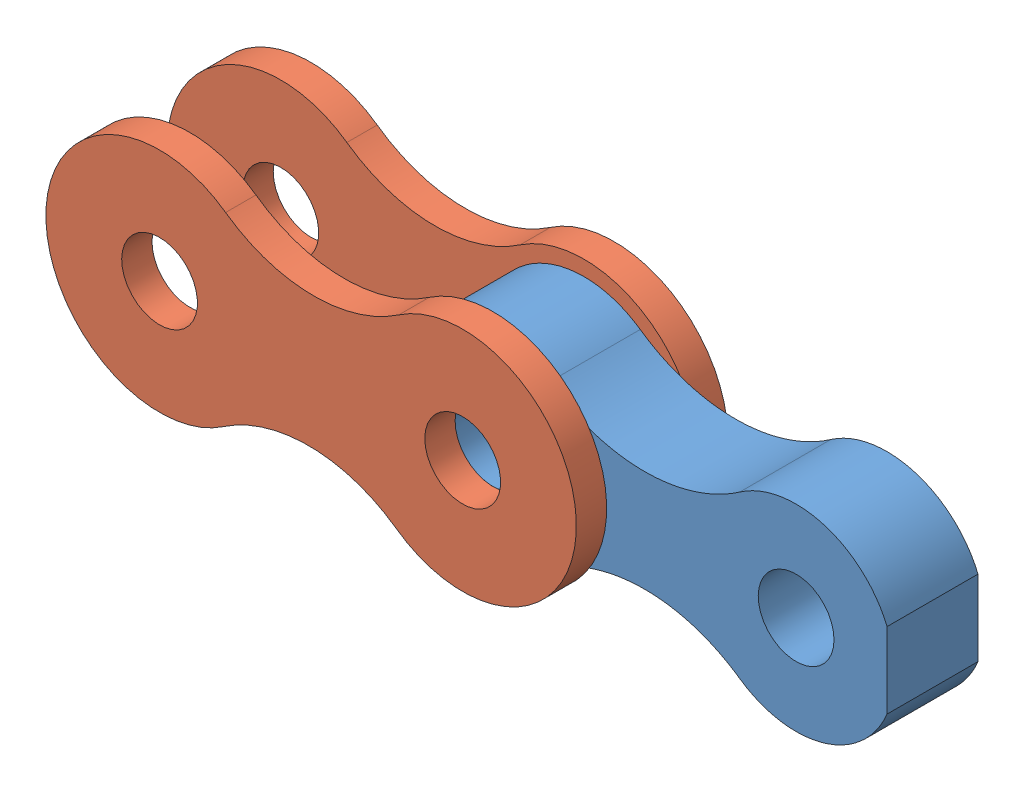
SolidWorks assembly TEILGLIED.SLDASM, configuration Standard (file format 3400). Lengths in mm.
Overall size (54.09 32.39 10).
3 component instances, 2 part files, 5 mates.
Components (placement in the parent):
- GLIED-1: GLIED.SLDPRT [Standard] at origin size (33 32.39 6)
- Lasche-1: Lasche.SLDPRT [Standard] at (-19.9986 0.2388 -5) x (0.999929 -0.011941 0) z (0 0 1) size (35 15 2)
- Lasche-2: Lasche.SLDPRT [Standard] at (-19.9986 0.2388 3) x (0.999929 -0.011941 0) z (0 0 1) size (35 15 2)
Mates (geometry in assembly coordinates):
- Konzentrisch1: concentric aligned: cylinder of GLIED-1; cylinder of Lasche-2
- Konzentrisch2: concentric aligned: cylinder of GLIED-1; cylinder of Lasche-1
- Deckungsgleich1: coincident anti-aligned: plane of GLIED-1 through (5 7.1807 -3) normal (0 0 -1); plane of Lasche-1 through (-14.9132 7.3593 -3) normal (0 0 1)
- Deckungsgleich2: coincident anti-aligned: plane of GLIED-1 through (5 7.1807 3) normal (0 0 1); plane of Lasche-2 through (-14.9132 7.3593 3) normal (0 0 -1)
- Konzentrisch3: concentric aligned: cylinder of Lasche-1; cylinder of Lasche-2
